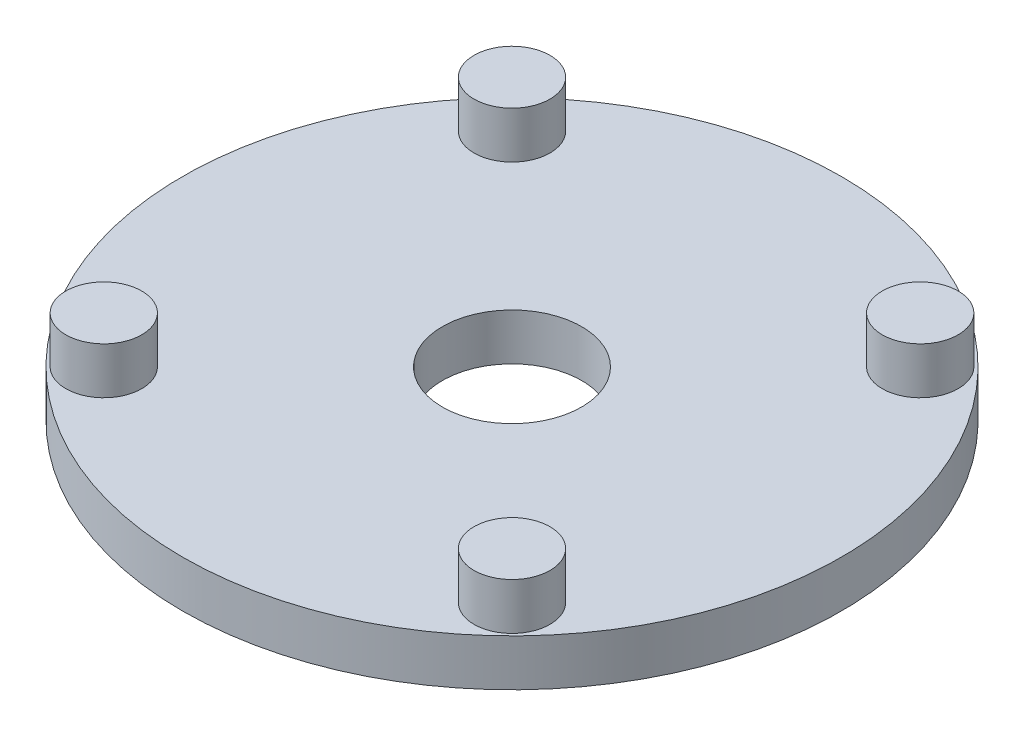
ISO-10303-21;
HEADER;
FILE_DESCRIPTION(('STEP AP214'),'2;1');
FILE_NAME('part.step','',(''),(''),'','','');
FILE_SCHEMA(('AUTOMOTIVE_DESIGN { 1 0 10303 214 1 1 1 1 }'));
ENDSEC;
DATA;
#1=APPLICATION_CONTEXT('core data for automotive mechanical design processes');
#2=APPLICATION_PROTOCOL_DEFINITION('international standard','automotive_design',2000,#1);
#3=PRODUCT_CONTEXT('',#1,'mechanical');
#4=PRODUCT('Part','Part','',(#3));
#5=PRODUCT_RELATED_PRODUCT_CATEGORY('part','',(#4));
#6=PRODUCT_DEFINITION_FORMATION('','',#4);
#7=PRODUCT_DEFINITION_CONTEXT('part definition',#1,'design');
#8=PRODUCT_DEFINITION('design','',#6,#7);
#9=PRODUCT_DEFINITION_SHAPE('','',#8);
#10=(LENGTH_UNIT() NAMED_UNIT(*) SI_UNIT(.MILLI.,.METRE.));
#11=(NAMED_UNIT(*) PLANE_ANGLE_UNIT() SI_UNIT($,.RADIAN.));
#12=(NAMED_UNIT(*) SI_UNIT($,.STERADIAN.) SOLID_ANGLE_UNIT());
#13=UNCERTAINTY_MEASURE_WITH_UNIT(LENGTH_MEASURE(1.E-05),#10,'distance_accuracy_value','');
#14=(GEOMETRIC_REPRESENTATION_CONTEXT(3) GLOBAL_UNCERTAINTY_ASSIGNED_CONTEXT((#13)) GLOBAL_UNIT_ASSIGNED_CONTEXT((#10,
#11,#12)) REPRESENTATION_CONTEXT('',''));
#15=CARTESIAN_POINT('',(0.,0.,0.));
#16=DIRECTION('',(0.,0.,1.));
#17=DIRECTION('',(1.,0.,0.));
#18=AXIS2_PLACEMENT_3D('',#15,#16,#17);
#19=CARTESIAN_POINT('',(0.,2.055,0.));
#20=DIRECTION('',(0.,1.,0.));
#21=DIRECTION('',(0.,0.,1.));
#22=AXIS2_PLACEMENT_3D('',#19,#20,#21);
#23=PLANE('',#22);
#24=CARTESIAN_POINT('',(17.9605122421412,2.055,-17.9605122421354));
#25=DIRECTION('',(0.,1.,0.));
#26=DIRECTION('',(0.,0.,1.));
#27=AXIS2_PLACEMENT_3D('',#24,#25,#26);
#28=CIRCLE('',#27,3.33999999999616);
#29=CARTESIAN_POINT('',(17.9605122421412,2.055,-14.6205122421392));
#30=VERTEX_POINT('',#29);
#31=EDGE_CURVE('E84',#30,#30,#28,.T.);
#32=ORIENTED_EDGE('',*,*,#31,.F.);
#33=EDGE_LOOP('',(#32));
#34=FACE_BOUND('',#33,.T.);
#35=CARTESIAN_POINT('',(17.9605122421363,2.055,17.9605122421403));
#36=DIRECTION('',(0.,1.,0.));
#37=DIRECTION('',(0.,0.,1.));
#38=AXIS2_PLACEMENT_3D('',#35,#36,#37);
#39=CIRCLE('',#38,3.33999999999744);
#40=CARTESIAN_POINT('',(17.9605122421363,2.055,21.3005122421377));
#41=VERTEX_POINT('',#40);
#42=EDGE_CURVE('E92',#41,#41,#39,.T.);
#43=ORIENTED_EDGE('',*,*,#42,.F.);
#44=EDGE_LOOP('',(#43));
#45=FACE_BOUND('',#44,.T.);
#46=CARTESIAN_POINT('',(-17.9605122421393,2.055,17.9605122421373));
#47=DIRECTION('',(0.,1.,0.));
#48=DIRECTION('',(0.,0.,1.));
#49=AXIS2_PLACEMENT_3D('',#46,#47,#48);
#50=CIRCLE('',#49,3.33999999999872);
#51=CARTESIAN_POINT('',(-17.9605122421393,2.055,21.300512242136));
#52=VERTEX_POINT('',#51);
#53=EDGE_CURVE('E76',#52,#52,#50,.T.);
#54=ORIENTED_EDGE('',*,*,#53,.F.);
#55=EDGE_LOOP('',(#54));
#56=FACE_BOUND('',#55,.T.);
#57=CARTESIAN_POINT('',(-17.9605122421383,2.055,-17.9605122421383));
#58=DIRECTION('',(0.,1.,0.));
#59=DIRECTION('',(0.,0.,1.));
#60=AXIS2_PLACEMENT_3D('',#57,#58,#59);
#61=CIRCLE('',#60,3.33999999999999);
#62=CARTESIAN_POINT('',(-17.9605122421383,2.055,-14.6205122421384));
#63=VERTEX_POINT('',#62);
#64=EDGE_CURVE('E72',#63,#63,#61,.T.);
#65=ORIENTED_EDGE('',*,*,#64,.F.);
#66=EDGE_LOOP('',(#65));
#67=FACE_BOUND('',#66,.T.);
#68=CARTESIAN_POINT('',(0.,2.055,0.));
#69=DIRECTION('',(0.,1.,0.));
#70=DIRECTION('',(0.,0.,1.));
#71=AXIS2_PLACEMENT_3D('',#68,#69,#70);
#72=CIRCLE('',#71,29.);
#73=CARTESIAN_POINT('',(0.,2.055,29.));
#74=VERTEX_POINT('',#73);
#75=EDGE_CURVE('E11',#74,#74,#72,.T.);
#76=ORIENTED_EDGE('',*,*,#75,.T.);
#77=EDGE_LOOP('',(#76));
#78=FACE_BOUND('',#77,.T.);
#79=CARTESIAN_POINT('',(0.,2.055,0.));
#80=DIRECTION('',(0.,1.,0.));
#81=DIRECTION('',(0.,0.,1.));
#82=AXIS2_PLACEMENT_3D('',#79,#80,#81);
#83=CIRCLE('',#82,6.13);
#84=CARTESIAN_POINT('',(0.,2.055,6.13));
#85=VERTEX_POINT('',#84);
#86=EDGE_CURVE('E62',#85,#85,#83,.T.);
#87=ORIENTED_EDGE('',*,*,#86,.F.);
#88=EDGE_LOOP('',(#87));
#89=FACE_BOUND('',#88,.T.);
#90=ADVANCED_FACE('F49',(#34,#45,#56,#67,#78,#89),#23,.T.);
#91=CARTESIAN_POINT('',(0.,-2.055,0.));
#92=DIRECTION('',(0.,1.,0.));
#93=DIRECTION('',(0.,0.,1.));
#94=AXIS2_PLACEMENT_3D('',#91,#92,#93);
#95=PLANE('',#94);
#96=CARTESIAN_POINT('',(0.,-2.055,0.));
#97=DIRECTION('',(0.,1.,0.));
#98=DIRECTION('',(0.,0.,1.));
#99=AXIS2_PLACEMENT_3D('',#96,#97,#98);
#100=CIRCLE('',#99,29.);
#101=CARTESIAN_POINT('',(0.,-2.055,29.));
#102=VERTEX_POINT('',#101);
#103=EDGE_CURVE('E53',#102,#102,#100,.T.);
#104=ORIENTED_EDGE('',*,*,#103,.F.);
#105=EDGE_LOOP('',(#104));
#106=FACE_BOUND('',#105,.T.);
#107=CARTESIAN_POINT('',(0.,-2.055,0.));
#108=DIRECTION('',(0.,1.,0.));
#109=DIRECTION('',(0.,0.,1.));
#110=AXIS2_PLACEMENT_3D('',#107,#108,#109);
#111=CIRCLE('',#110,6.13);
#112=CARTESIAN_POINT('',(0.,-2.055,6.13));
#113=VERTEX_POINT('',#112);
#114=EDGE_CURVE('E64',#113,#113,#111,.T.);
#115=ORIENTED_EDGE('',*,*,#114,.T.);
#116=EDGE_LOOP('',(#115));
#117=FACE_BOUND('',#116,.T.);
#118=ADVANCED_FACE('F108',(#106,#117),#95,.F.);
#119=CARTESIAN_POINT('',(0.,2.055,0.));
#120=DIRECTION('',(0.,-1.,0.));
#121=DIRECTION('',(0.,0.,-1.));
#122=AXIS2_PLACEMENT_3D('',#119,#120,#121);
#123=CYLINDRICAL_SURFACE('',#122,29.);
#124=ORIENTED_EDGE('',*,*,#75,.F.);
#125=EDGE_LOOP('',(#124));
#126=FACE_BOUND('',#125,.T.);
#127=ORIENTED_EDGE('',*,*,#103,.T.);
#128=EDGE_LOOP('',(#127));
#129=FACE_BOUND('',#128,.T.);
#130=ADVANCED_FACE('F51',(#126,#129),#123,.T.);
#131=CARTESIAN_POINT('',(0.,2.055,0.));
#132=DIRECTION('',(0.,-1.,0.));
#133=DIRECTION('',(0.,0.,-1.));
#134=AXIS2_PLACEMENT_3D('',#131,#132,#133);
#135=CYLINDRICAL_SURFACE('',#134,6.13);
#136=ORIENTED_EDGE('',*,*,#86,.T.);
#137=EDGE_LOOP('',(#136));
#138=FACE_BOUND('',#137,.T.);
#139=ORIENTED_EDGE('',*,*,#114,.F.);
#140=EDGE_LOOP('',(#139));
#141=FACE_BOUND('',#140,.T.);
#142=ADVANCED_FACE('F115',(#138,#141),#135,.F.);
#143=CARTESIAN_POINT('',(-17.9605122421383,6.165,-17.9605122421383));
#144=DIRECTION('',(0.,-1.,0.));
#145=DIRECTION('',(0.,0.,-1.));
#146=AXIS2_PLACEMENT_3D('',#143,#144,#145);
#147=CYLINDRICAL_SURFACE('',#146,3.33999999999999);
#148=CARTESIAN_POINT('',(-17.9605122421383,6.165,-17.9605122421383));
#149=DIRECTION('',(0.,1.,0.));
#150=DIRECTION('',(0.,0.,1.));
#151=AXIS2_PLACEMENT_3D('',#148,#149,#150);
#152=CIRCLE('',#151,3.33999999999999);
#153=CARTESIAN_POINT('',(-17.9605122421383,6.165,-14.6205122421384));
#154=VERTEX_POINT('',#153);
#155=EDGE_CURVE('E68',#154,#154,#152,.T.);
#156=ORIENTED_EDGE('',*,*,#155,.F.);
#157=EDGE_LOOP('',(#156));
#158=FACE_BOUND('',#157,.T.);
#159=ORIENTED_EDGE('',*,*,#64,.T.);
#160=EDGE_LOOP('',(#159));
#161=FACE_BOUND('',#160,.T.);
#162=ADVANCED_FACE('F118',(#158,#161),#147,.T.);
#163=CARTESIAN_POINT('',(-17.9605122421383,6.165,-17.9605122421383));
#164=DIRECTION('',(0.,1.,0.));
#165=DIRECTION('',(0.,0.,1.));
#166=AXIS2_PLACEMENT_3D('',#163,#164,#165);
#167=PLANE('',#166);
#168=ORIENTED_EDGE('',*,*,#155,.T.);
#169=EDGE_LOOP('',(#168));
#170=FACE_BOUND('',#169,.T.);
#171=ADVANCED_FACE('F132',(#170),#167,.T.);
#172=CARTESIAN_POINT('',(-17.9605122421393,6.165,17.9605122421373));
#173=DIRECTION('',(0.,-1.,0.));
#174=DIRECTION('',(0.,0.,-1.));
#175=AXIS2_PLACEMENT_3D('',#172,#173,#174);
#176=CYLINDRICAL_SURFACE('',#175,3.33999999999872);
#177=CARTESIAN_POINT('',(-17.9605122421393,6.165,17.9605122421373));
#178=DIRECTION('',(0.,1.,0.));
#179=DIRECTION('',(0.,0.,1.));
#180=AXIS2_PLACEMENT_3D('',#177,#178,#179);
#181=CIRCLE('',#180,3.33999999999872);
#182=CARTESIAN_POINT('',(-17.9605122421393,6.165,21.300512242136));
#183=VERTEX_POINT('',#182);
#184=EDGE_CURVE('E96',#183,#183,#181,.T.);
#185=ORIENTED_EDGE('',*,*,#184,.F.);
#186=EDGE_LOOP('',(#185));
#187=FACE_BOUND('',#186,.T.);
#188=ORIENTED_EDGE('',*,*,#53,.T.);
#189=EDGE_LOOP('',(#188));
#190=FACE_BOUND('',#189,.T.);
#191=ADVANCED_FACE('F104',(#187,#190),#176,.T.);
#192=CARTESIAN_POINT('',(-17.9605122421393,6.165,17.9605122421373));
#193=DIRECTION('',(0.,1.,0.));
#194=DIRECTION('',(0.,0.,1.));
#195=AXIS2_PLACEMENT_3D('',#192,#193,#194);
#196=PLANE('',#195);
#197=ORIENTED_EDGE('',*,*,#184,.T.);
#198=EDGE_LOOP('',(#197));
#199=FACE_BOUND('',#198,.T.);
#200=ADVANCED_FACE('F152',(#199),#196,.T.);
#201=CARTESIAN_POINT('',(17.9605122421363,6.165,17.9605122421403));
#202=DIRECTION('',(0.,-1.,0.));
#203=DIRECTION('',(0.,0.,-1.));
#204=AXIS2_PLACEMENT_3D('',#201,#202,#203);
#205=CYLINDRICAL_SURFACE('',#204,3.33999999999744);
#206=CARTESIAN_POINT('',(17.9605122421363,6.165,17.9605122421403));
#207=DIRECTION('',(0.,1.,0.));
#208=DIRECTION('',(0.,0.,1.));
#209=AXIS2_PLACEMENT_3D('',#206,#207,#208);
#210=CIRCLE('',#209,3.33999999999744);
#211=CARTESIAN_POINT('',(17.9605122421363,6.165,21.3005122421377));
#212=VERTEX_POINT('',#211);
#213=EDGE_CURVE('E88',#212,#212,#210,.T.);
#214=ORIENTED_EDGE('',*,*,#213,.F.);
#215=EDGE_LOOP('',(#214));
#216=FACE_BOUND('',#215,.T.);
#217=ORIENTED_EDGE('',*,*,#42,.T.);
#218=EDGE_LOOP('',(#217));
#219=FACE_BOUND('',#218,.T.);
#220=ADVANCED_FACE('F148',(#216,#219),#205,.T.);
#221=CARTESIAN_POINT('',(17.9605122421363,6.165,17.9605122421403));
#222=DIRECTION('',(0.,1.,0.));
#223=DIRECTION('',(0.,0.,1.));
#224=AXIS2_PLACEMENT_3D('',#221,#222,#223);
#225=PLANE('',#224);
#226=ORIENTED_EDGE('',*,*,#213,.T.);
#227=EDGE_LOOP('',(#226));
#228=FACE_BOUND('',#227,.T.);
#229=ADVANCED_FACE('F144',(#228),#225,.T.);
#230=CARTESIAN_POINT('',(17.9605122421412,6.165,-17.9605122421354));
#231=DIRECTION('',(0.,-1.,0.));
#232=DIRECTION('',(0.,0.,-1.));
#233=AXIS2_PLACEMENT_3D('',#230,#231,#232);
#234=CYLINDRICAL_SURFACE('',#233,3.33999999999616);
#235=CARTESIAN_POINT('',(17.9605122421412,6.165,-17.9605122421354));
#236=DIRECTION('',(0.,1.,0.));
#237=DIRECTION('',(0.,0.,1.));
#238=AXIS2_PLACEMENT_3D('',#235,#236,#237);
#239=CIRCLE('',#238,3.33999999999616);
#240=CARTESIAN_POINT('',(17.9605122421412,6.165,-14.6205122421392));
#241=VERTEX_POINT('',#240);
#242=EDGE_CURVE('E80',#241,#241,#239,.T.);
#243=ORIENTED_EDGE('',*,*,#242,.F.);
#244=EDGE_LOOP('',(#243));
#245=FACE_BOUND('',#244,.T.);
#246=ORIENTED_EDGE('',*,*,#31,.T.);
#247=EDGE_LOOP('',(#246));
#248=FACE_BOUND('',#247,.T.);
#249=ADVANCED_FACE('F140',(#245,#248),#234,.T.);
#250=CARTESIAN_POINT('',(17.9605122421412,6.165,-17.9605122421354));
#251=DIRECTION('',(0.,1.,0.));
#252=DIRECTION('',(0.,0.,1.));
#253=AXIS2_PLACEMENT_3D('',#250,#251,#252);
#254=PLANE('',#253);
#255=ORIENTED_EDGE('',*,*,#242,.T.);
#256=EDGE_LOOP('',(#255));
#257=FACE_BOUND('',#256,.T.);
#258=ADVANCED_FACE('F137',(#257),#254,.T.);
#259=CLOSED_SHELL('',(#90,#118,#130,#142,#162,#171,#191,#200,#220,#229,#249,#258));
#260=MANIFOLD_SOLID_BREP('B2',#259);
#261=ADVANCED_BREP_SHAPE_REPRESENTATION('',(#18,#260),#14);
#262=SHAPE_DEFINITION_REPRESENTATION(#9,#261);
ENDSEC;
END-ISO-10303-21;
